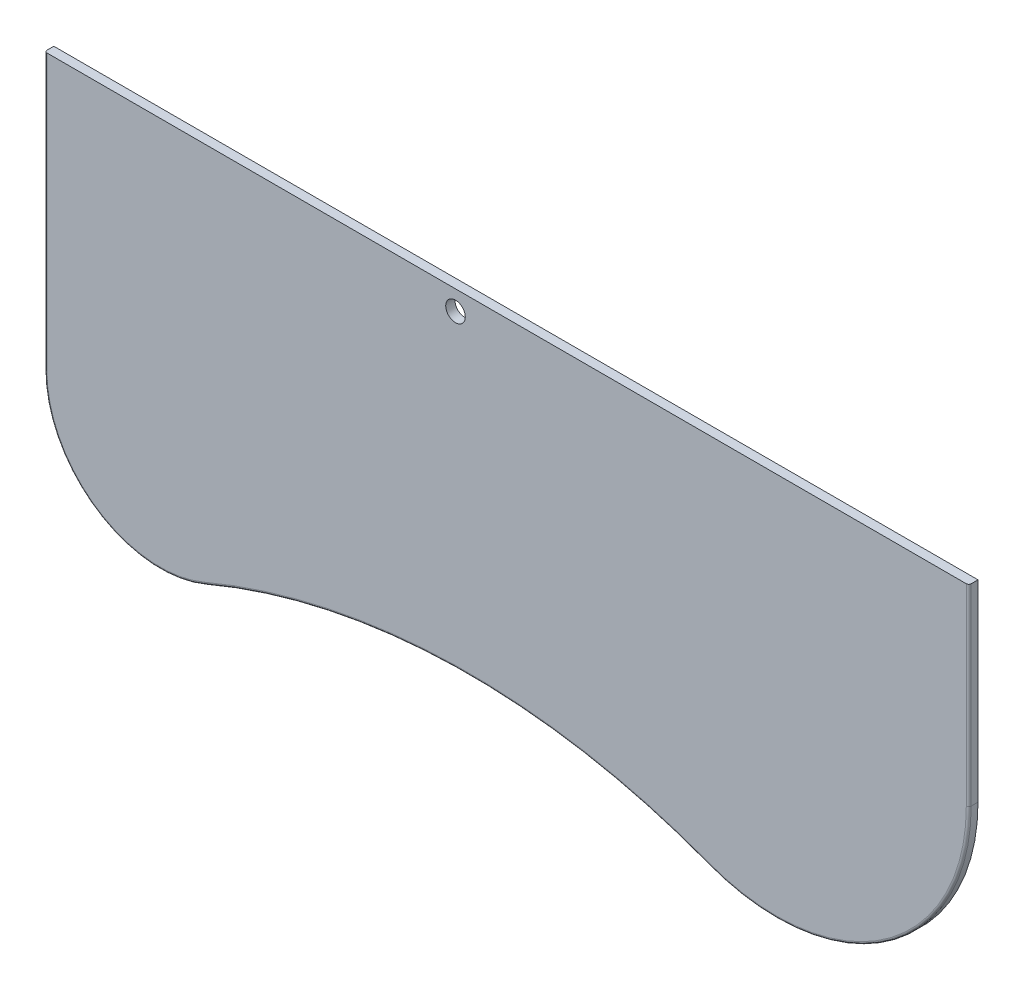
ISO-10303-21;
HEADER;
FILE_DESCRIPTION(('STEP AP214'),'2;1');
FILE_NAME('part.step','',(''),(''),'','','');
FILE_SCHEMA(('AUTOMOTIVE_DESIGN { 1 0 10303 214 1 1 1 1 }'));
ENDSEC;
DATA;
#1=APPLICATION_CONTEXT('core data for automotive mechanical design processes');
#2=APPLICATION_PROTOCOL_DEFINITION('international standard','automotive_design',2000,#1);
#3=PRODUCT_CONTEXT('',#1,'mechanical');
#4=PRODUCT('Part','Part','',(#3));
#5=PRODUCT_RELATED_PRODUCT_CATEGORY('part','',(#4));
#6=PRODUCT_DEFINITION_FORMATION('','',#4);
#7=PRODUCT_DEFINITION_CONTEXT('part definition',#1,'design');
#8=PRODUCT_DEFINITION('design','',#6,#7);
#9=PRODUCT_DEFINITION_SHAPE('','',#8);
#10=(LENGTH_UNIT() NAMED_UNIT(*) SI_UNIT(.MILLI.,.METRE.));
#11=(NAMED_UNIT(*) PLANE_ANGLE_UNIT() SI_UNIT($,.RADIAN.));
#12=(NAMED_UNIT(*) SI_UNIT($,.STERADIAN.) SOLID_ANGLE_UNIT());
#13=UNCERTAINTY_MEASURE_WITH_UNIT(LENGTH_MEASURE(1.E-05),#10,'distance_accuracy_value','');
#14=(GEOMETRIC_REPRESENTATION_CONTEXT(3) GLOBAL_UNCERTAINTY_ASSIGNED_CONTEXT((#13)) GLOBAL_UNIT_ASSIGNED_CONTEXT((#10,
#11,#12)) REPRESENTATION_CONTEXT('',''));
#15=CARTESIAN_POINT('',(0.,0.,0.));
#16=DIRECTION('',(0.,0.,1.));
#17=DIRECTION('',(1.,0.,0.));
#18=AXIS2_PLACEMENT_3D('',#15,#16,#17);
#19=CARTESIAN_POINT('',(0.,0.,-12.));
#20=DIRECTION('',(0.,1.,0.));
#21=DIRECTION('',(0.,0.,1.));
#22=AXIS2_PLACEMENT_3D('',#19,#20,#21);
#23=PLANE('',#22);
#24=DIRECTION('',(-1.,0.,0.));
#25=VECTOR('',#24,1.);
#26=CARTESIAN_POINT('',(0.,0.,0.));
#27=LINE('',#26,#25);
#28=CARTESIAN_POINT('',(1196.825,0.,0.));
#29=VERTEX_POINT('',#28);
#30=CARTESIAN_POINT('',(3.17500000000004,0.,0.));
#31=VERTEX_POINT('',#30);
#32=EDGE_CURVE('E147',#29,#31,#27,.T.);
#33=ORIENTED_EDGE('',*,*,#32,.F.);
#34=CARTESIAN_POINT('',(1196.825,0.,-3.175));
#35=DIRECTION('',(0.,1.,0.));
#36=DIRECTION('',(0.,0.,1.));
#37=AXIS2_PLACEMENT_3D('',#34,#35,#36);
#38=CIRCLE('',#37,3.175);
#39=CARTESIAN_POINT('',(1200.,0.,-3.175));
#40=VERTEX_POINT('',#39);
#41=EDGE_CURVE('E256',#29,#40,#38,.T.);
#42=ORIENTED_EDGE('',*,*,#41,.T.);
#43=DIRECTION('',(0.,0.,1.));
#44=VECTOR('',#43,1.);
#45=CARTESIAN_POINT('',(1200.,0.,-12.));
#46=LINE('',#45,#44);
#47=CARTESIAN_POINT('',(1200.,0.,-12.));
#48=VERTEX_POINT('',#47);
#49=EDGE_CURVE('E145',#48,#40,#46,.T.);
#50=ORIENTED_EDGE('',*,*,#49,.F.);
#51=DIRECTION('',(-1.,0.,0.));
#52=VECTOR('',#51,1.);
#53=CARTESIAN_POINT('',(0.,0.,-12.));
#54=LINE('',#53,#52);
#55=CARTESIAN_POINT('',(0.,0.,-12.));
#56=VERTEX_POINT('',#55);
#57=EDGE_CURVE('E136',#48,#56,#54,.T.);
#58=ORIENTED_EDGE('',*,*,#57,.T.);
#59=DIRECTION('',(0.,0.,1.));
#60=VECTOR('',#59,1.);
#61=CARTESIAN_POINT('',(0.,0.,-12.));
#62=LINE('',#61,#60);
#63=CARTESIAN_POINT('',(0.,0.,-3.175));
#64=VERTEX_POINT('',#63);
#65=EDGE_CURVE('E119',#56,#64,#62,.T.);
#66=ORIENTED_EDGE('',*,*,#65,.T.);
#67=CARTESIAN_POINT('',(3.17500000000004,0.,-3.175));
#68=DIRECTION('',(0.,1.,0.));
#69=DIRECTION('',(0.,0.,1.));
#70=AXIS2_PLACEMENT_3D('',#67,#68,#69);
#71=CIRCLE('',#70,3.175);
#72=EDGE_CURVE('E217',#64,#31,#71,.T.);
#73=ORIENTED_EDGE('',*,*,#72,.T.);
#74=EDGE_LOOP('',(#33,#42,#50,#58,#66,#73));
#75=FACE_BOUND('',#74,.T.);
#76=ADVANCED_FACE('F45',(#75),#23,.T.);
#77=CARTESIAN_POINT('',(1200.,-250.,-12.));
#78=DIRECTION('',(1.,0.,0.));
#79=DIRECTION('',(0.,0.,-1.));
#80=AXIS2_PLACEMENT_3D('',#77,#78,#79);
#81=PLANE('',#80);
#82=ORIENTED_EDGE('',*,*,#49,.T.);
#83=DIRECTION('',(0.,1.,0.));
#84=VECTOR('',#83,1.);
#85=CARTESIAN_POINT('',(1200.,-250.,-3.175));
#86=LINE('',#85,#84);
#87=CARTESIAN_POINT('',(1200.,-250.,-3.175));
#88=VERTEX_POINT('',#87);
#89=EDGE_CURVE('E259',#40,#88,#86,.F.);
#90=ORIENTED_EDGE('',*,*,#89,.T.);
#91=DIRECTION('',(0.,0.,1.));
#92=VECTOR('',#91,1.);
#93=CARTESIAN_POINT('',(1200.,-250.,-12.));
#94=LINE('',#93,#92);
#95=CARTESIAN_POINT('',(1200.,-250.,-12.));
#96=VERTEX_POINT('',#95);
#97=EDGE_CURVE('E173',#96,#88,#94,.T.);
#98=ORIENTED_EDGE('',*,*,#97,.F.);
#99=DIRECTION('',(0.,1.,0.));
#100=VECTOR('',#99,1.);
#101=CARTESIAN_POINT('',(1200.,-250.,-12.));
#102=LINE('',#101,#100);
#103=EDGE_CURVE('E129',#96,#48,#102,.T.);
#104=ORIENTED_EDGE('',*,*,#103,.T.);
#105=EDGE_LOOP('',(#82,#90,#98,#104));
#106=FACE_BOUND('',#105,.T.);
#107=ADVANCED_FACE('F301',(#106),#81,.T.);
#108=CARTESIAN_POINT('',(950.,-250.,-12.));
#109=DIRECTION('',(0.,0.,1.));
#110=DIRECTION('',(1.,0.,0.));
#111=AXIS2_PLACEMENT_3D('',#108,#109,#110);
#112=CYLINDRICAL_SURFACE('',#111,250.);
#113=ORIENTED_EDGE('',*,*,#97,.T.);
#114=CARTESIAN_POINT('',(950.,-250.,-3.175));
#115=DIRECTION('',(0.,0.,1.));
#116=DIRECTION('',(1.,0.,0.));
#117=AXIS2_PLACEMENT_3D('',#114,#115,#116);
#118=CIRCLE('',#117,250.);
#119=CARTESIAN_POINT('',(861.032801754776,-483.633982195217,-3.175));
#120=VERTEX_POINT('',#119);
#121=EDGE_CURVE('E248',#88,#120,#118,.F.);
#122=ORIENTED_EDGE('',*,*,#121,.T.);
#123=DIRECTION('',(0.,0.,1.));
#124=VECTOR('',#123,1.);
#125=CARTESIAN_POINT('',(861.032801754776,-483.633982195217,-12.));
#126=LINE('',#125,#124);
#127=CARTESIAN_POINT('',(861.032801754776,-483.633982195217,-12.));
#128=VERTEX_POINT('',#127);
#129=EDGE_CURVE('E185',#128,#120,#126,.T.);
#130=ORIENTED_EDGE('',*,*,#129,.F.);
#131=CARTESIAN_POINT('',(950.,-250.,-12.));
#132=DIRECTION('',(0.,0.,1.));
#133=DIRECTION('',(1.,0.,0.));
#134=AXIS2_PLACEMENT_3D('',#131,#132,#133);
#135=CIRCLE('',#134,250.);
#136=EDGE_CURVE('E200',#128,#96,#135,.T.);
#137=ORIENTED_EDGE('',*,*,#136,.T.);
#138=EDGE_LOOP('',(#113,#122,#130,#137));
#139=FACE_BOUND('',#138,.T.);
#140=ADVANCED_FACE('F269',(#139),#112,.T.);
#141=CARTESIAN_POINT('',(550.,-1300.4275139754,-12.));
#142=DIRECTION('',(0.,0.,1.));
#143=DIRECTION('',(1.,0.,0.));
#144=AXIS2_PLACEMENT_3D('',#141,#142,#143);
#145=CYLINDRICAL_SURFACE('',#144,874.009769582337);
#146=ORIENTED_EDGE('',*,*,#129,.T.);
#147=CARTESIAN_POINT('',(550.,-1300.4275139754,-3.175));
#148=DIRECTION('',(0.,0.,1.));
#149=DIRECTION('',(1.,0.,0.));
#150=AXIS2_PLACEMENT_3D('',#147,#148,#149);
#151=CIRCLE('',#150,874.009769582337);
#152=CARTESIAN_POINT('',(208.593190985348,-495.856530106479,-3.175));
#153=VERTEX_POINT('',#152);
#154=EDGE_CURVE('E71',#120,#153,#151,.T.);
#155=ORIENTED_EDGE('',*,*,#154,.T.);
#156=DIRECTION('',(0.,0.,1.));
#157=VECTOR('',#156,1.);
#158=CARTESIAN_POINT('',(208.593190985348,-495.856530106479,-12.));
#159=LINE('',#158,#157);
#160=CARTESIAN_POINT('',(208.593190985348,-495.856530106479,-12.));
#161=VERTEX_POINT('',#160);
#162=EDGE_CURVE('E188',#161,#153,#159,.T.);
#163=ORIENTED_EDGE('',*,*,#162,.F.);
#164=CARTESIAN_POINT('',(550.,-1300.4275139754,-12.));
#165=DIRECTION('',(0.,0.,-1.));
#166=DIRECTION('',(-1.,0.,0.));
#167=AXIS2_PLACEMENT_3D('',#164,#165,#166);
#168=CIRCLE('',#167,874.009769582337);
#169=EDGE_CURVE('E204',#161,#128,#168,.T.);
#170=ORIENTED_EDGE('',*,*,#169,.T.);
#171=EDGE_LOOP('',(#146,#155,#163,#170));
#172=FACE_BOUND('',#171,.T.);
#173=ADVANCED_FACE('F273',(#172),#145,.F.);
#174=CARTESIAN_POINT('',(150.,-357.773808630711,-12.));
#175=DIRECTION('',(0.,0.,1.));
#176=DIRECTION('',(1.,0.,0.));
#177=AXIS2_PLACEMENT_3D('',#174,#175,#176);
#178=CYLINDRICAL_SURFACE('',#177,150.);
#179=ORIENTED_EDGE('',*,*,#162,.T.);
#180=CARTESIAN_POINT('',(150.,-357.773808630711,-3.175));
#181=DIRECTION('',(0.,0.,1.));
#182=DIRECTION('',(1.,0.,0.));
#183=AXIS2_PLACEMENT_3D('',#180,#181,#182);
#184=CIRCLE('',#183,150.);
#185=CARTESIAN_POINT('',(0.,-357.773808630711,-3.175));
#186=VERTEX_POINT('',#185);
#187=EDGE_CURVE('E56',#153,#186,#184,.F.);
#188=ORIENTED_EDGE('',*,*,#187,.T.);
#189=DIRECTION('',(0.,0.,1.));
#190=VECTOR('',#189,1.);
#191=CARTESIAN_POINT('',(0.,-357.773808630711,-12.));
#192=LINE('',#191,#190);
#193=CARTESIAN_POINT('',(0.,-357.773808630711,-12.));
#194=VERTEX_POINT('',#193);
#195=EDGE_CURVE('E128',#194,#186,#192,.T.);
#196=ORIENTED_EDGE('',*,*,#195,.F.);
#197=CARTESIAN_POINT('',(150.,-357.773808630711,-12.));
#198=DIRECTION('',(0.,0.,1.));
#199=DIRECTION('',(1.,0.,0.));
#200=AXIS2_PLACEMENT_3D('',#197,#198,#199);
#201=CIRCLE('',#200,150.);
#202=EDGE_CURVE('E140',#194,#161,#201,.T.);
#203=ORIENTED_EDGE('',*,*,#202,.T.);
#204=EDGE_LOOP('',(#179,#188,#196,#203));
#205=FACE_BOUND('',#204,.T.);
#206=ADVANCED_FACE('F211',(#205),#178,.T.);
#207=CARTESIAN_POINT('',(0.,0.,-12.));
#208=DIRECTION('',(-1.,0.,0.));
#209=DIRECTION('',(0.,0.,1.));
#210=AXIS2_PLACEMENT_3D('',#207,#208,#209);
#211=PLANE('',#210);
#212=ORIENTED_EDGE('',*,*,#195,.T.);
#213=DIRECTION('',(0.,-1.,0.));
#214=VECTOR('',#213,1.);
#215=CARTESIAN_POINT('',(0.,0.,-3.175));
#216=LINE('',#215,#214);
#217=EDGE_CURVE('E12',#186,#64,#216,.F.);
#218=ORIENTED_EDGE('',*,*,#217,.T.);
#219=ORIENTED_EDGE('',*,*,#65,.F.);
#220=DIRECTION('',(0.,-1.,0.));
#221=VECTOR('',#220,1.);
#222=CARTESIAN_POINT('',(0.,0.,-12.));
#223=LINE('',#222,#221);
#224=EDGE_CURVE('E122',#56,#194,#223,.T.);
#225=ORIENTED_EDGE('',*,*,#224,.T.);
#226=EDGE_LOOP('',(#212,#218,#219,#225));
#227=FACE_BOUND('',#226,.T.);
#228=ADVANCED_FACE('F121',(#227),#211,.T.);
#229=CARTESIAN_POINT('',(950.,-250.,-12.));
#230=DIRECTION('',(0.,0.,1.));
#231=DIRECTION('',(1.,0.,0.));
#232=AXIS2_PLACEMENT_3D('',#229,#230,#231);
#233=PLANE('',#232);
#234=CARTESIAN_POINT('',(533.570047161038,-25.4,-12.));
#235=DIRECTION('',(0.,0.,1.));
#236=DIRECTION('',(1.,0.,0.));
#237=AXIS2_PLACEMENT_3D('',#234,#235,#236);
#238=CIRCLE('',#237,12.7);
#239=CARTESIAN_POINT('',(546.270047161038,-25.4,-12.));
#240=VERTEX_POINT('',#239);
#241=EDGE_CURVE('E241',#240,#240,#238,.T.);
#242=ORIENTED_EDGE('',*,*,#241,.T.);
#243=EDGE_LOOP('',(#242));
#244=FACE_BOUND('',#243,.T.);
#245=ORIENTED_EDGE('',*,*,#57,.F.);
#246=ORIENTED_EDGE('',*,*,#103,.F.);
#247=ORIENTED_EDGE('',*,*,#136,.F.);
#248=ORIENTED_EDGE('',*,*,#169,.F.);
#249=ORIENTED_EDGE('',*,*,#202,.F.);
#250=ORIENTED_EDGE('',*,*,#224,.F.);
#251=EDGE_LOOP('',(#245,#246,#247,#248,#249,#250));
#252=FACE_BOUND('',#251,.T.);
#253=ADVANCED_FACE('F134',(#244,#252),#233,.F.);
#254=CARTESIAN_POINT('',(950.,-250.,0.));
#255=DIRECTION('',(0.,0.,1.));
#256=DIRECTION('',(1.,0.,0.));
#257=AXIS2_PLACEMENT_3D('',#254,#255,#256);
#258=PLANE('',#257);
#259=CARTESIAN_POINT('',(533.570047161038,-25.4,0.));
#260=DIRECTION('',(0.,0.,1.));
#261=DIRECTION('',(1.,0.,0.));
#262=AXIS2_PLACEMENT_3D('',#259,#260,#261);
#263=CIRCLE('',#262,12.7);
#264=CARTESIAN_POINT('',(546.270047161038,-25.4,0.));
#265=VERTEX_POINT('',#264);
#266=EDGE_CURVE('E153',#265,#265,#263,.T.);
#267=ORIENTED_EDGE('',*,*,#266,.F.);
#268=EDGE_LOOP('',(#267));
#269=FACE_BOUND('',#268,.T.);
#270=CARTESIAN_POINT('',(950.,-250.,0.));
#271=DIRECTION('',(0.,0.,1.));
#272=DIRECTION('',(1.,0.,0.));
#273=AXIS2_PLACEMENT_3D('',#270,#271,#272);
#274=CIRCLE('',#273,246.825);
#275=CARTESIAN_POINT('',(862.16268517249,-480.666830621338,0.));
#276=VERTEX_POINT('',#275);
#277=CARTESIAN_POINT('',(1196.825,-250.,0.));
#278=VERTEX_POINT('',#277);
#279=EDGE_CURVE('E278',#276,#278,#274,.T.);
#280=ORIENTED_EDGE('',*,*,#279,.T.);
#281=DIRECTION('',(0.,1.,0.));
#282=VECTOR('',#281,1.);
#283=CARTESIAN_POINT('',(1196.825,-250.,0.));
#284=LINE('',#283,#282);
#285=EDGE_CURVE('E283',#278,#29,#284,.T.);
#286=ORIENTED_EDGE('',*,*,#285,.T.);
#287=ORIENTED_EDGE('',*,*,#32,.T.);
#288=DIRECTION('',(0.,-1.,0.));
#289=VECTOR('',#288,1.);
#290=CARTESIAN_POINT('',(3.17500000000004,-250.,0.));
#291=LINE('',#290,#289);
#292=CARTESIAN_POINT('',(3.17500000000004,-357.773808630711,0.));
#293=VERTEX_POINT('',#292);
#294=EDGE_CURVE('E172',#31,#293,#291,.T.);
#295=ORIENTED_EDGE('',*,*,#294,.T.);
#296=CARTESIAN_POINT('',(150.,-357.773808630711,0.));
#297=DIRECTION('',(0.,0.,1.));
#298=DIRECTION('',(1.,0.,0.));
#299=AXIS2_PLACEMENT_3D('',#296,#297,#298);
#300=CIRCLE('',#299,146.825);
#301=CARTESIAN_POINT('',(207.352968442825,-492.933779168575,0.));
#302=VERTEX_POINT('',#301);
#303=EDGE_CURVE('E222',#293,#302,#300,.T.);
#304=ORIENTED_EDGE('',*,*,#303,.T.);
#305=CARTESIAN_POINT('',(550.,-1300.4275139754,0.));
#306=DIRECTION('',(0.,0.,1.));
#307=DIRECTION('',(1.,0.,0.));
#308=AXIS2_PLACEMENT_3D('',#305,#306,#307);
#309=CIRCLE('',#308,877.184769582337);
#310=EDGE_CURVE('E284',#302,#276,#309,.F.);
#311=ORIENTED_EDGE('',*,*,#310,.T.);
#312=EDGE_LOOP('',(#280,#286,#287,#295,#304,#311));
#313=FACE_BOUND('',#312,.T.);
#314=ADVANCED_FACE('F298',(#269,#313),#258,.T.);
#315=CARTESIAN_POINT('',(3.17500000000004,-250.,-3.175));
#316=DIRECTION('',(0.,-1.,0.));
#317=DIRECTION('',(0.,0.,-1.));
#318=AXIS2_PLACEMENT_3D('',#315,#316,#317);
#319=CYLINDRICAL_SURFACE('',#318,3.175);
#320=ORIENTED_EDGE('',*,*,#72,.F.);
#321=ORIENTED_EDGE('',*,*,#217,.F.);
#322=CARTESIAN_POINT('',(3.17500000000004,-357.773808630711,-3.175));
#323=DIRECTION('',(0.,-1.,0.));
#324=DIRECTION('',(0.,0.,-1.));
#325=AXIS2_PLACEMENT_3D('',#322,#323,#324);
#326=CIRCLE('',#325,3.175);
#327=EDGE_CURVE('E49',#293,#186,#326,.T.);
#328=ORIENTED_EDGE('',*,*,#327,.F.);
#329=ORIENTED_EDGE('',*,*,#294,.F.);
#330=EDGE_LOOP('',(#320,#321,#328,#329));
#331=FACE_BOUND('',#330,.T.);
#332=ADVANCED_FACE('F47',(#331),#319,.T.);
#333=CARTESIAN_POINT('',(150.,-357.773808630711,-3.175));
#334=DIRECTION('',(0.,0.,1.));
#335=DIRECTION('',(1.,0.,0.));
#336=AXIS2_PLACEMENT_3D('',#333,#334,#335);
#337=TOROIDAL_SURFACE('',#336,146.825,3.175);
#338=ORIENTED_EDGE('',*,*,#327,.T.);
#339=ORIENTED_EDGE('',*,*,#187,.F.);
#340=CARTESIAN_POINT('',(207.352968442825,-492.933779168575,-3.175));
#341=DIRECTION('',(0.920551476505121,0.390621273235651,0.));
#342=DIRECTION('',(-0.390621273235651,0.920551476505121,0.));
#343=AXIS2_PLACEMENT_3D('',#340,#341,#342);
#344=CIRCLE('',#343,3.175);
#345=EDGE_CURVE('E224',#302,#153,#344,.T.);
#346=ORIENTED_EDGE('',*,*,#345,.F.);
#347=ORIENTED_EDGE('',*,*,#303,.F.);
#348=EDGE_LOOP('',(#338,#339,#346,#347));
#349=FACE_BOUND('',#348,.T.);
#350=ADVANCED_FACE('F219',(#349),#337,.T.);
#351=CARTESIAN_POINT('',(550.,-1300.4275139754,-3.175));
#352=DIRECTION('',(0.,0.,1.));
#353=DIRECTION('',(1.,0.,0.));
#354=AXIS2_PLACEMENT_3D('',#351,#352,#353);
#355=TOROIDAL_SURFACE('',#354,877.184769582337,3.175);
#356=ORIENTED_EDGE('',*,*,#345,.T.);
#357=ORIENTED_EDGE('',*,*,#154,.F.);
#358=CARTESIAN_POINT('',(862.16268517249,-480.666830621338,-3.175));
#359=DIRECTION('',(0.934535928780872,-0.355868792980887,0.));
#360=DIRECTION('',(0.355868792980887,0.934535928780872,0.));
#361=AXIS2_PLACEMENT_3D('',#358,#359,#360);
#362=CIRCLE('',#361,3.175);
#363=EDGE_CURVE('E226',#276,#120,#362,.T.);
#364=ORIENTED_EDGE('',*,*,#363,.F.);
#365=ORIENTED_EDGE('',*,*,#310,.F.);
#366=EDGE_LOOP('',(#356,#357,#364,#365));
#367=FACE_BOUND('',#366,.T.);
#368=ADVANCED_FACE('F275',(#367),#355,.T.);
#369=CARTESIAN_POINT('',(950.,-250.,-3.175));
#370=DIRECTION('',(0.,0.,1.));
#371=DIRECTION('',(1.,0.,0.));
#372=AXIS2_PLACEMENT_3D('',#369,#370,#371);
#373=TOROIDAL_SURFACE('',#372,246.825,3.175);
#374=ORIENTED_EDGE('',*,*,#363,.T.);
#375=ORIENTED_EDGE('',*,*,#121,.F.);
#376=CARTESIAN_POINT('',(1196.825,-250.,-3.175));
#377=DIRECTION('',(0.,1.,0.));
#378=DIRECTION('',(0.,0.,1.));
#379=AXIS2_PLACEMENT_3D('',#376,#377,#378);
#380=CIRCLE('',#379,3.175);
#381=EDGE_CURVE('E231',#278,#88,#380,.T.);
#382=ORIENTED_EDGE('',*,*,#381,.F.);
#383=ORIENTED_EDGE('',*,*,#279,.F.);
#384=EDGE_LOOP('',(#374,#375,#382,#383));
#385=FACE_BOUND('',#384,.T.);
#386=ADVANCED_FACE('F277',(#385),#373,.T.);
#387=CARTESIAN_POINT('',(1196.825,-250.,-3.175));
#388=DIRECTION('',(0.,1.,0.));
#389=DIRECTION('',(0.,0.,1.));
#390=AXIS2_PLACEMENT_3D('',#387,#388,#389);
#391=CYLINDRICAL_SURFACE('',#390,3.175);
#392=ORIENTED_EDGE('',*,*,#381,.T.);
#393=ORIENTED_EDGE('',*,*,#89,.F.);
#394=ORIENTED_EDGE('',*,*,#41,.F.);
#395=ORIENTED_EDGE('',*,*,#285,.F.);
#396=EDGE_LOOP('',(#392,#393,#394,#395));
#397=FACE_BOUND('',#396,.T.);
#398=ADVANCED_FACE('F302',(#397),#391,.T.);
#399=CARTESIAN_POINT('',(533.570047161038,-25.4,-12.));
#400=DIRECTION('',(0.,0.,1.));
#401=DIRECTION('',(1.,0.,0.));
#402=AXIS2_PLACEMENT_3D('',#399,#400,#401);
#403=CYLINDRICAL_SURFACE('',#402,12.7);
#404=ORIENTED_EDGE('',*,*,#241,.F.);
#405=EDGE_LOOP('',(#404));
#406=FACE_BOUND('',#405,.T.);
#407=ORIENTED_EDGE('',*,*,#266,.T.);
#408=EDGE_LOOP('',(#407));
#409=FACE_BOUND('',#408,.T.);
#410=ADVANCED_FACE('F304',(#406,#409),#403,.F.);
#411=CLOSED_SHELL('',(#76,#107,#140,#173,#206,#228,#253,#314,#332,#350,#368,#386,#398,#410));
#412=MANIFOLD_SOLID_BREP('B2',#411);
#413=ADVANCED_BREP_SHAPE_REPRESENTATION('',(#18,#412),#14);
#414=SHAPE_DEFINITION_REPRESENTATION(#9,#413);
ENDSEC;
END-ISO-10303-21;
